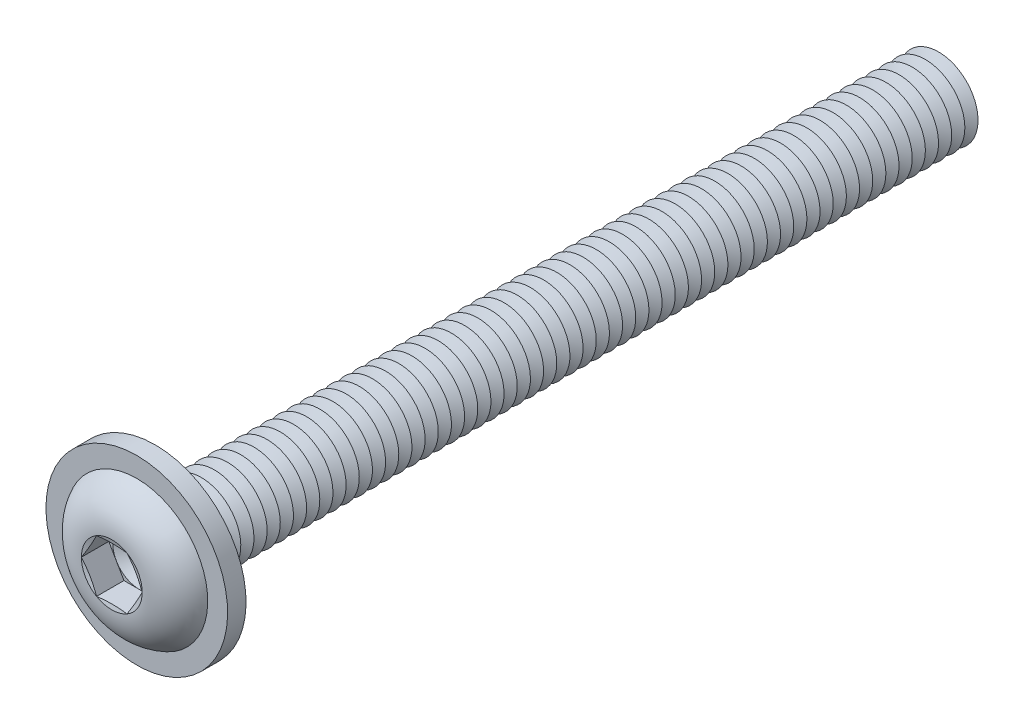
from build123d import *

# Parameters (mm, degrees)
FILLET1_R           = 0.25
LPATTERN1_COUNT     = 60
LPATTERN1_PITCH     = 0.5
CUT_EXTRUDE1_DEPTH  = 1.04
SKETCH5_R           = 3.45
SKETCH5_R_2         = 1.75
BOSS_EXTRUDE1_DEPTH = 0.7


with BuildPart() as part:
    # Sketch1 → Revolve1 (revolve)
    with BuildSketch(Plane(origin=(0, 0, 0), x_dir=(0, 0, -1), z_dir=(1, 0, 0))):
        with BuildLine():
            Line((0, 1.5), (0, 2.85))
            ThreePointArc((0, 2.85), (-1.182850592, 2.35063849), (-1.65, 1.1547))
            Line((-1.65, 1.1547), (-1.495299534, 0.57735))
            Line((-1.495299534, 0.57735), (-1.65, 0.57735))
            Line((-1.65, 0.57735), (-1.65, 0))
            Line((-1.65, 0), (30, 0))
            Line((30, 0), (30, 1.5))
            Line((30, 1.5), (0, 1.5))
        make_face()
    revolve(axis=Axis((0, 0, -30), (0, 0, 1)))

    # Fillet1
    fillet1_edges = [part.edges().sort_by_distance(p)[0] for p in [
        (0, -1.5, 0),
    ]]
    fillet(fillet1_edges, radius=FILLET1_R)

    # Sketch2 → Cut-Revolve1 (revolve, cut)
    with BuildSketch(Plane(origin=(0, 0, 0), x_dir=(0, 0, -1), z_dir=(1, 0, 0))):
        Polygon((29.75, 1.5), (30.25, 1.5), (30, 1.066987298), align=None)
    cut_revolve1 = revolve(axis=Axis((0, 0, -30), (0, 0, -1)), mode=Mode.SUBTRACT)

    # LPattern1: Cut-Revolve1 ×60
    with Locations(*[(0, 0, i * LPATTERN1_PITCH) for i in range(1, LPATTERN1_COUNT)]):
        add(cut_revolve1, mode=Mode.SUBTRACT)

    # Sketch3 → Cut-Extrude1 (cut)
    with BuildSketch(Plane.XY.offset(1.65)):
        Polygon((0.57735, 0.999999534), (-0.57735, 0.999999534), (-1.1547, 0), (-0.57735, -0.999999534), (0.57735, -0.999999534), (1.1547, 0), align=None)
    extrude(amount=-CUT_EXTRUDE1_DEPTH, mode=Mode.SUBTRACT)

    # Cut-Extrude2 cone 1 section (on through the dimple's axis) → Cut-Extrude2 (revolve, cut)
    with BuildSketch(Plane(origin=(0, 0, 0.61), x_dir=(0, -1, 0), z_dir=(1, 0, 0))):
        Polygon((0, 0), (0.999999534, 0), (0, 0.57735), align=None)
    revolve(axis=Axis((0, 0, 0.61), (0, 0, -1)), mode=Mode.SUBTRACT)

    # Sketch5 → Boss-Extrude1 (add)
    with BuildSketch(Plane(origin=(0, 0, 0), x_dir=(-1, 0, 0), z_dir=(0, 0, -1))):
        with Locations(Location((0, 0, 0), (0, 0, 90))):
            Circle(SKETCH5_R)
        Circle(SKETCH5_R_2, mode=Mode.SUBTRACT)
    extrude(amount=-BOSS_EXTRUDE1_DEPTH)


solid = part.part
